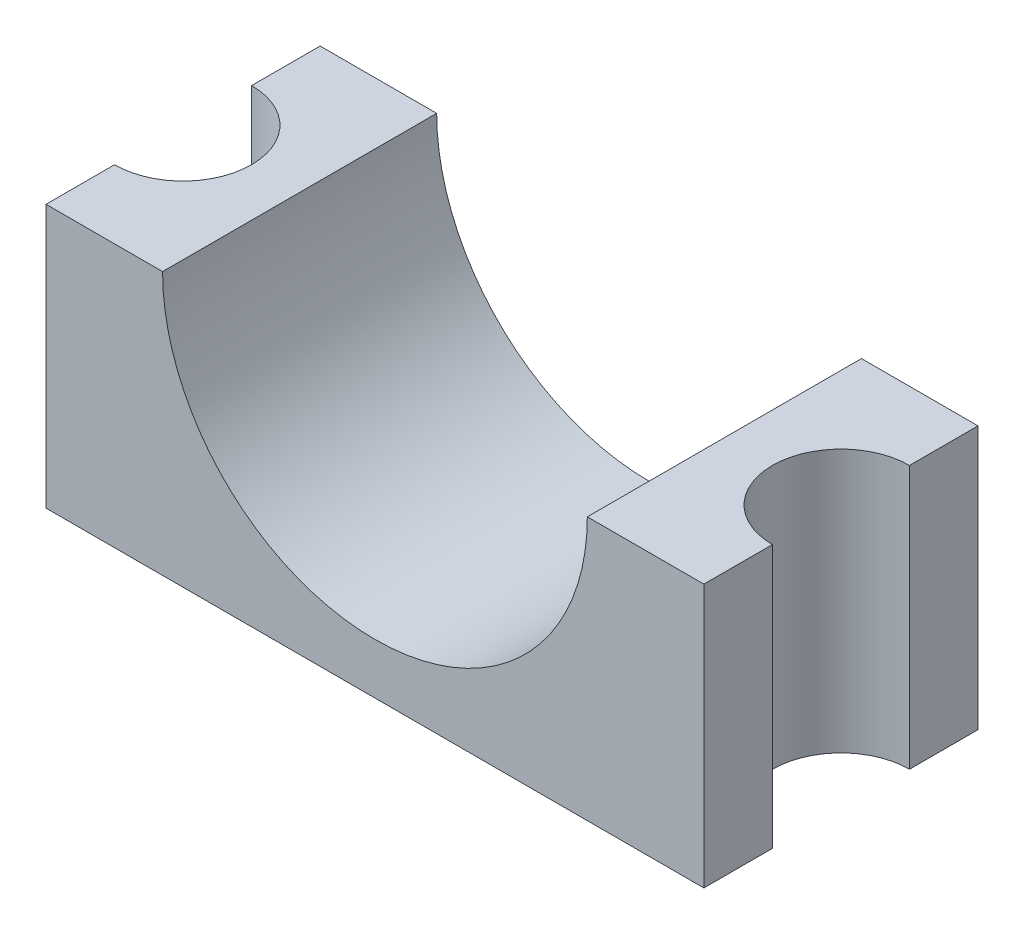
ISO-10303-21;
HEADER;
FILE_DESCRIPTION(('STEP AP214'),'2;1');
FILE_NAME('part.step','',(''),(''),'','','');
FILE_SCHEMA(('AUTOMOTIVE_DESIGN { 1 0 10303 214 1 1 1 1 }'));
ENDSEC;
DATA;
#1=APPLICATION_CONTEXT('core data for automotive mechanical design processes');
#2=APPLICATION_PROTOCOL_DEFINITION('international standard','automotive_design',2000,#1);
#3=PRODUCT_CONTEXT('',#1,'mechanical');
#4=PRODUCT('Part','Part','',(#3));
#5=PRODUCT_RELATED_PRODUCT_CATEGORY('part','',(#4));
#6=PRODUCT_DEFINITION_FORMATION('','',#4);
#7=PRODUCT_DEFINITION_CONTEXT('part definition',#1,'design');
#8=PRODUCT_DEFINITION('design','',#6,#7);
#9=PRODUCT_DEFINITION_SHAPE('','',#8);
#10=(LENGTH_UNIT() NAMED_UNIT(*) SI_UNIT(.MILLI.,.METRE.));
#11=(NAMED_UNIT(*) PLANE_ANGLE_UNIT() SI_UNIT($,.RADIAN.));
#12=(NAMED_UNIT(*) SI_UNIT($,.STERADIAN.) SOLID_ANGLE_UNIT());
#13=UNCERTAINTY_MEASURE_WITH_UNIT(LENGTH_MEASURE(1.E-05),#10,'distance_accuracy_value','');
#14=(GEOMETRIC_REPRESENTATION_CONTEXT(3) GLOBAL_UNCERTAINTY_ASSIGNED_CONTEXT((#13)) GLOBAL_UNIT_ASSIGNED_CONTEXT((#10,
#11,#12)) REPRESENTATION_CONTEXT('',''));
#15=CARTESIAN_POINT('',(0.,0.,0.));
#16=DIRECTION('',(0.,0.,1.));
#17=DIRECTION('',(1.,0.,0.));
#18=AXIS2_PLACEMENT_3D('',#15,#16,#17);
#19=CARTESIAN_POINT('',(0.,0.,-31.75));
#20=DIRECTION('',(-1.,0.,0.));
#21=DIRECTION('',(0.,0.,1.));
#22=AXIS2_PLACEMENT_3D('',#19,#20,#21);
#23=PLANE('',#22);
#24=DIRECTION('',(0.,-1.,0.));
#25=VECTOR('',#24,1.);
#26=CARTESIAN_POINT('',(0.,0.,0.));
#27=LINE('',#26,#25);
#28=CARTESIAN_POINT('',(0.,30.48,0.));
#29=VERTEX_POINT('',#28);
#30=CARTESIAN_POINT('',(0.,0.,0.));
#31=VERTEX_POINT('',#30);
#32=EDGE_CURVE('E123',#29,#31,#27,.T.);
#33=ORIENTED_EDGE('',*,*,#32,.F.);
#34=DIRECTION('',(0.,0.,-1.));
#35=VECTOR('',#34,1.);
#36=CARTESIAN_POINT('',(0.,30.48,-31.75));
#37=LINE('',#36,#35);
#38=CARTESIAN_POINT('',(0.,30.48,-7.9375));
#39=VERTEX_POINT('',#38);
#40=EDGE_CURVE('E122',#29,#39,#37,.T.);
#41=ORIENTED_EDGE('',*,*,#40,.T.);
#42=DIRECTION('',(0.,1.,0.));
#43=VECTOR('',#42,1.);
#44=CARTESIAN_POINT('',(0.,0.,-7.9375));
#45=LINE('',#44,#43);
#46=CARTESIAN_POINT('',(0.,0.,-7.9375));
#47=VERTEX_POINT('',#46);
#48=EDGE_CURVE('E109',#47,#39,#45,.T.);
#49=ORIENTED_EDGE('',*,*,#48,.F.);
#50=DIRECTION('',(0.,0.,1.));
#51=VECTOR('',#50,1.);
#52=CARTESIAN_POINT('',(0.,0.,-31.75));
#53=LINE('',#52,#51);
#54=EDGE_CURVE('E174',#47,#31,#53,.T.);
#55=ORIENTED_EDGE('',*,*,#54,.T.);
#56=EDGE_LOOP('',(#33,#41,#49,#55));
#57=FACE_BOUND('',#56,.T.);
#58=ADVANCED_FACE('F31',(#57),#23,.T.);
#59=CARTESIAN_POINT('',(76.2,0.,-31.75));
#60=DIRECTION('',(1.,0.,0.));
#61=DIRECTION('',(0.,0.,-1.));
#62=AXIS2_PLACEMENT_3D('',#59,#60,#61);
#63=PLANE('',#62);
#64=DIRECTION('',(0.,1.,0.));
#65=VECTOR('',#64,1.);
#66=CARTESIAN_POINT('',(76.2,0.,-31.75));
#67=LINE('',#66,#65);
#68=CARTESIAN_POINT('',(76.2,0.,-31.75));
#69=VERTEX_POINT('',#68);
#70=CARTESIAN_POINT('',(76.2,30.48,-31.75));
#71=VERTEX_POINT('',#70);
#72=EDGE_CURVE('E172',#69,#71,#67,.T.);
#73=ORIENTED_EDGE('',*,*,#72,.T.);
#74=DIRECTION('',(0.,0.,1.));
#75=VECTOR('',#74,1.);
#76=CARTESIAN_POINT('',(76.2,30.48,-31.75));
#77=LINE('',#76,#75);
#78=CARTESIAN_POINT('',(76.2,30.48,-23.8125));
#79=VERTEX_POINT('',#78);
#80=EDGE_CURVE('E144',#71,#79,#77,.T.);
#81=ORIENTED_EDGE('',*,*,#80,.T.);
#82=DIRECTION('',(0.,1.,0.));
#83=VECTOR('',#82,1.);
#84=CARTESIAN_POINT('',(76.2,0.,-23.8125));
#85=LINE('',#84,#83);
#86=CARTESIAN_POINT('',(76.2,0.,-23.8125));
#87=VERTEX_POINT('',#86);
#88=EDGE_CURVE('E153',#87,#79,#85,.T.);
#89=ORIENTED_EDGE('',*,*,#88,.F.);
#90=DIRECTION('',(0.,0.,1.));
#91=VECTOR('',#90,1.);
#92=CARTESIAN_POINT('',(76.2,0.,-31.75));
#93=LINE('',#92,#91);
#94=EDGE_CURVE('E175',#69,#87,#93,.T.);
#95=ORIENTED_EDGE('',*,*,#94,.F.);
#96=EDGE_LOOP('',(#73,#81,#89,#95));
#97=FACE_BOUND('',#96,.T.);
#98=ADVANCED_FACE('F189',(#97),#63,.T.);
#99=DIRECTION('',(0.,1.,0.));
#100=VECTOR('',#99,1.);
#101=CARTESIAN_POINT('',(0.,0.,-23.8125));
#102=LINE('',#101,#100);
#103=CARTESIAN_POINT('',(0.,30.48,-23.8125));
#104=VERTEX_POINT('',#103);
#105=CARTESIAN_POINT('',(0.,0.,-23.8125));
#106=VERTEX_POINT('',#105);
#107=EDGE_CURVE('E118',#104,#106,#102,.F.);
#108=ORIENTED_EDGE('',*,*,#107,.F.);
#109=DIRECTION('',(0.,0.,-1.));
#110=VECTOR('',#109,1.);
#111=CARTESIAN_POINT('',(0.,30.48,-31.75));
#112=LINE('',#111,#110);
#113=CARTESIAN_POINT('',(0.,30.48,-31.75));
#114=VERTEX_POINT('',#113);
#115=EDGE_CURVE('E53',#104,#114,#112,.T.);
#116=ORIENTED_EDGE('',*,*,#115,.T.);
#117=DIRECTION('',(0.,-1.,0.));
#118=VECTOR('',#117,1.);
#119=CARTESIAN_POINT('',(0.,0.,-31.75));
#120=LINE('',#119,#118);
#121=CARTESIAN_POINT('',(0.,0.,-31.75));
#122=VERTEX_POINT('',#121);
#123=EDGE_CURVE('E167',#114,#122,#120,.T.);
#124=ORIENTED_EDGE('',*,*,#123,.T.);
#125=EDGE_CURVE('E179',#122,#106,#53,.T.);
#126=ORIENTED_EDGE('',*,*,#125,.T.);
#127=EDGE_LOOP('',(#108,#116,#124,#126));
#128=FACE_BOUND('',#127,.T.);
#129=ADVANCED_FACE('F218',(#128),#23,.T.);
#130=DIRECTION('',(0.,1.,0.));
#131=VECTOR('',#130,1.);
#132=CARTESIAN_POINT('',(76.2,0.,-7.93750000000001));
#133=LINE('',#132,#131);
#134=CARTESIAN_POINT('',(76.2,30.48,-7.93750000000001));
#135=VERTEX_POINT('',#134);
#136=CARTESIAN_POINT('',(76.2,0.,-7.93750000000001));
#137=VERTEX_POINT('',#136);
#138=EDGE_CURVE('E117',#135,#137,#133,.F.);
#139=ORIENTED_EDGE('',*,*,#138,.F.);
#140=DIRECTION('',(0.,0.,1.));
#141=VECTOR('',#140,1.);
#142=CARTESIAN_POINT('',(76.2,30.48,-31.75));
#143=LINE('',#142,#141);
#144=CARTESIAN_POINT('',(76.2,30.48,0.));
#145=VERTEX_POINT('',#144);
#146=EDGE_CURVE('E142',#135,#145,#143,.T.);
#147=ORIENTED_EDGE('',*,*,#146,.T.);
#148=DIRECTION('',(0.,1.,0.));
#149=VECTOR('',#148,1.);
#150=CARTESIAN_POINT('',(76.2,0.,0.));
#151=LINE('',#150,#149);
#152=CARTESIAN_POINT('',(76.2,0.,0.));
#153=VERTEX_POINT('',#152);
#154=EDGE_CURVE('E164',#153,#145,#151,.T.);
#155=ORIENTED_EDGE('',*,*,#154,.F.);
#156=EDGE_CURVE('E178',#137,#153,#93,.T.);
#157=ORIENTED_EDGE('',*,*,#156,.F.);
#158=EDGE_LOOP('',(#139,#147,#155,#157));
#159=FACE_BOUND('',#158,.T.);
#160=ADVANCED_FACE('F200',(#159),#63,.T.);
#161=CARTESIAN_POINT('',(0.,60.96,-31.75));
#162=DIRECTION('',(0.,0.,-1.));
#163=DIRECTION('',(-1.,0.,0.));
#164=AXIS2_PLACEMENT_3D('',#161,#162,#163);
#165=PLANE('',#164);
#166=ORIENTED_EDGE('',*,*,#123,.F.);
#167=DIRECTION('',(1.,0.,0.));
#168=VECTOR('',#167,1.);
#169=CARTESIAN_POINT('',(0.,30.48,-31.75));
#170=LINE('',#169,#168);
#171=CARTESIAN_POINT('',(13.5001,30.48,-31.75));
#172=VERTEX_POINT('',#171);
#173=EDGE_CURVE('E131',#114,#172,#170,.T.);
#174=ORIENTED_EDGE('',*,*,#173,.T.);
#175=CARTESIAN_POINT('',(38.1,30.48,-31.75));
#176=DIRECTION('',(0.,0.,1.));
#177=DIRECTION('',(1.,0.,0.));
#178=AXIS2_PLACEMENT_3D('',#175,#176,#177);
#179=CIRCLE('',#178,24.5999);
#180=CARTESIAN_POINT('',(62.6999,30.48,-31.75));
#181=VERTEX_POINT('',#180);
#182=EDGE_CURVE('E158',#172,#181,#179,.T.);
#183=ORIENTED_EDGE('',*,*,#182,.T.);
#184=EDGE_CURVE('E45',#181,#71,#170,.T.);
#185=ORIENTED_EDGE('',*,*,#184,.T.);
#186=ORIENTED_EDGE('',*,*,#72,.F.);
#187=DIRECTION('',(1.,0.,0.));
#188=VECTOR('',#187,1.);
#189=CARTESIAN_POINT('',(0.,0.,-31.75));
#190=LINE('',#189,#188);
#191=EDGE_CURVE('E169',#122,#69,#190,.T.);
#192=ORIENTED_EDGE('',*,*,#191,.F.);
#193=EDGE_LOOP('',(#166,#174,#183,#185,#186,#192));
#194=FACE_BOUND('',#193,.T.);
#195=ADVANCED_FACE('F194',(#194),#165,.T.);
#196=CARTESIAN_POINT('',(0.,60.96,0.));
#197=DIRECTION('',(0.,0.,-1.));
#198=DIRECTION('',(-1.,0.,0.));
#199=AXIS2_PLACEMENT_3D('',#196,#197,#198);
#200=PLANE('',#199);
#201=DIRECTION('',(1.,0.,0.));
#202=VECTOR('',#201,1.);
#203=CARTESIAN_POINT('',(0.,30.48,0.));
#204=LINE('',#203,#202);
#205=CARTESIAN_POINT('',(13.5001,30.48,0.));
#206=VERTEX_POINT('',#205);
#207=EDGE_CURVE('E126',#29,#206,#204,.T.);
#208=ORIENTED_EDGE('',*,*,#207,.F.);
#209=ORIENTED_EDGE('',*,*,#32,.T.);
#210=DIRECTION('',(1.,0.,0.));
#211=VECTOR('',#210,1.);
#212=CARTESIAN_POINT('',(0.,0.,0.));
#213=LINE('',#212,#211);
#214=EDGE_CURVE('E161',#31,#153,#213,.T.);
#215=ORIENTED_EDGE('',*,*,#214,.T.);
#216=ORIENTED_EDGE('',*,*,#154,.T.);
#217=CARTESIAN_POINT('',(62.6999,30.48,0.));
#218=VERTEX_POINT('',#217);
#219=EDGE_CURVE('E135',#218,#145,#204,.T.);
#220=ORIENTED_EDGE('',*,*,#219,.F.);
#221=CARTESIAN_POINT('',(38.1,30.48,0.));
#222=DIRECTION('',(0.,0.,1.));
#223=DIRECTION('',(1.,0.,0.));
#224=AXIS2_PLACEMENT_3D('',#221,#222,#223);
#225=CIRCLE('',#224,24.5999);
#226=EDGE_CURVE('E155',#206,#218,#225,.T.);
#227=ORIENTED_EDGE('',*,*,#226,.F.);
#228=EDGE_LOOP('',(#208,#209,#215,#216,#220,#227));
#229=FACE_BOUND('',#228,.T.);
#230=ADVANCED_FACE('F204',(#229),#200,.F.);
#231=CARTESIAN_POINT('',(38.1,30.48,-31.75));
#232=DIRECTION('',(0.,0.,1.));
#233=DIRECTION('',(1.,0.,0.));
#234=AXIS2_PLACEMENT_3D('',#231,#232,#233);
#235=CYLINDRICAL_SURFACE('',#234,24.5999);
#236=DIRECTION('',(0.,0.,1.));
#237=VECTOR('',#236,1.);
#238=CARTESIAN_POINT('',(13.5001,30.48,-31.75));
#239=LINE('',#238,#237);
#240=EDGE_CURVE('E137',#206,#172,#239,.F.);
#241=ORIENTED_EDGE('',*,*,#240,.F.);
#242=ORIENTED_EDGE('',*,*,#226,.T.);
#243=DIRECTION('',(0.,0.,1.));
#244=VECTOR('',#243,1.);
#245=CARTESIAN_POINT('',(62.6999,30.48,-31.75));
#246=LINE('',#245,#244);
#247=EDGE_CURVE('E147',#181,#218,#246,.T.);
#248=ORIENTED_EDGE('',*,*,#247,.F.);
#249=ORIENTED_EDGE('',*,*,#182,.F.);
#250=EDGE_LOOP('',(#241,#242,#248,#249));
#251=FACE_BOUND('',#250,.T.);
#252=ADVANCED_FACE('F208',(#251),#235,.F.);
#253=CARTESIAN_POINT('',(76.2,0.,-15.875));
#254=DIRECTION('',(0.,1.,0.));
#255=DIRECTION('',(0.,0.,1.));
#256=AXIS2_PLACEMENT_3D('',#253,#254,#255);
#257=CYLINDRICAL_SURFACE('',#256,7.93749999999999);
#258=CARTESIAN_POINT('',(76.2,30.48,-15.875));
#259=DIRECTION('',(0.,1.,0.));
#260=DIRECTION('',(0.,0.,1.));
#261=AXIS2_PLACEMENT_3D('',#258,#259,#260);
#262=CIRCLE('',#261,7.93749999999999);
#263=EDGE_CURVE('E139',#135,#79,#262,.F.);
#264=ORIENTED_EDGE('',*,*,#263,.F.);
#265=ORIENTED_EDGE('',*,*,#138,.T.);
#266=CARTESIAN_POINT('',(76.2,0.,-15.875));
#267=DIRECTION('',(0.,-1.,0.));
#268=DIRECTION('',(0.,0.,-1.));
#269=AXIS2_PLACEMENT_3D('',#266,#267,#268);
#270=CIRCLE('',#269,7.93749999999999);
#271=EDGE_CURVE('E38',#137,#87,#270,.T.);
#272=ORIENTED_EDGE('',*,*,#271,.T.);
#273=ORIENTED_EDGE('',*,*,#88,.T.);
#274=EDGE_LOOP('',(#264,#265,#272,#273));
#275=FACE_BOUND('',#274,.T.);
#276=ADVANCED_FACE('F184',(#275),#257,.F.);
#277=CARTESIAN_POINT('',(0.,0.,-15.875));
#278=DIRECTION('',(0.,1.,0.));
#279=DIRECTION('',(0.,0.,1.));
#280=AXIS2_PLACEMENT_3D('',#277,#278,#279);
#281=CYLINDRICAL_SURFACE('',#280,7.9375);
#282=CARTESIAN_POINT('',(0.,30.48,-15.875));
#283=DIRECTION('',(0.,1.,0.));
#284=DIRECTION('',(0.,0.,1.));
#285=AXIS2_PLACEMENT_3D('',#282,#283,#284);
#286=CIRCLE('',#285,7.9375);
#287=EDGE_CURVE('E11',#104,#39,#286,.F.);
#288=ORIENTED_EDGE('',*,*,#287,.F.);
#289=ORIENTED_EDGE('',*,*,#107,.T.);
#290=CARTESIAN_POINT('',(0.,0.,-15.875));
#291=DIRECTION('',(0.,1.,0.));
#292=DIRECTION('',(0.,0.,1.));
#293=AXIS2_PLACEMENT_3D('',#290,#291,#292);
#294=CIRCLE('',#293,7.9375);
#295=EDGE_CURVE('E113',#47,#106,#294,.T.);
#296=ORIENTED_EDGE('',*,*,#295,.F.);
#297=ORIENTED_EDGE('',*,*,#48,.T.);
#298=EDGE_LOOP('',(#288,#289,#296,#297));
#299=FACE_BOUND('',#298,.T.);
#300=ADVANCED_FACE('F111',(#299),#281,.F.);
#301=CARTESIAN_POINT('',(0.,0.,-31.75));
#302=DIRECTION('',(0.,-1.,0.));
#303=DIRECTION('',(0.,0.,-1.));
#304=AXIS2_PLACEMENT_3D('',#301,#302,#303);
#305=PLANE('',#304);
#306=ORIENTED_EDGE('',*,*,#295,.T.);
#307=ORIENTED_EDGE('',*,*,#125,.F.);
#308=ORIENTED_EDGE('',*,*,#191,.T.);
#309=ORIENTED_EDGE('',*,*,#94,.T.);
#310=ORIENTED_EDGE('',*,*,#271,.F.);
#311=ORIENTED_EDGE('',*,*,#156,.T.);
#312=ORIENTED_EDGE('',*,*,#214,.F.);
#313=ORIENTED_EDGE('',*,*,#54,.F.);
#314=EDGE_LOOP('',(#306,#307,#308,#309,#310,#311,#312,#313));
#315=FACE_BOUND('',#314,.T.);
#316=ADVANCED_FACE('F191',(#315),#305,.T.);
#317=CARTESIAN_POINT('',(-7.07726716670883,30.48,138.19541146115));
#318=DIRECTION('',(0.,1.,0.));
#319=DIRECTION('',(0.,0.,1.));
#320=AXIS2_PLACEMENT_3D('',#317,#318,#319);
#321=PLANE('',#320);
#322=ORIENTED_EDGE('',*,*,#207,.T.);
#323=ORIENTED_EDGE('',*,*,#240,.T.);
#324=ORIENTED_EDGE('',*,*,#173,.F.);
#325=ORIENTED_EDGE('',*,*,#115,.F.);
#326=ORIENTED_EDGE('',*,*,#287,.T.);
#327=ORIENTED_EDGE('',*,*,#40,.F.);
#328=EDGE_LOOP('',(#322,#323,#324,#325,#326,#327));
#329=FACE_BOUND('',#328,.T.);
#330=ADVANCED_FACE('F128',(#329),#321,.T.);
#331=ORIENTED_EDGE('',*,*,#184,.F.);
#332=ORIENTED_EDGE('',*,*,#247,.T.);
#333=ORIENTED_EDGE('',*,*,#219,.T.);
#334=ORIENTED_EDGE('',*,*,#146,.F.);
#335=ORIENTED_EDGE('',*,*,#263,.T.);
#336=ORIENTED_EDGE('',*,*,#80,.F.);
#337=EDGE_LOOP('',(#331,#332,#333,#334,#335,#336));
#338=FACE_BOUND('',#337,.T.);
#339=ADVANCED_FACE('F196',(#338),#321,.T.);
#340=CLOSED_SHELL('',(#58,#98,#129,#160,#195,#230,#252,#276,#300,#316,#330,#339));
#341=MANIFOLD_SOLID_BREP('B2',#340);
#342=ADVANCED_BREP_SHAPE_REPRESENTATION('',(#18,#341),#14);
#343=SHAPE_DEFINITION_REPRESENTATION(#9,#342);
ENDSEC;
END-ISO-10303-21;
